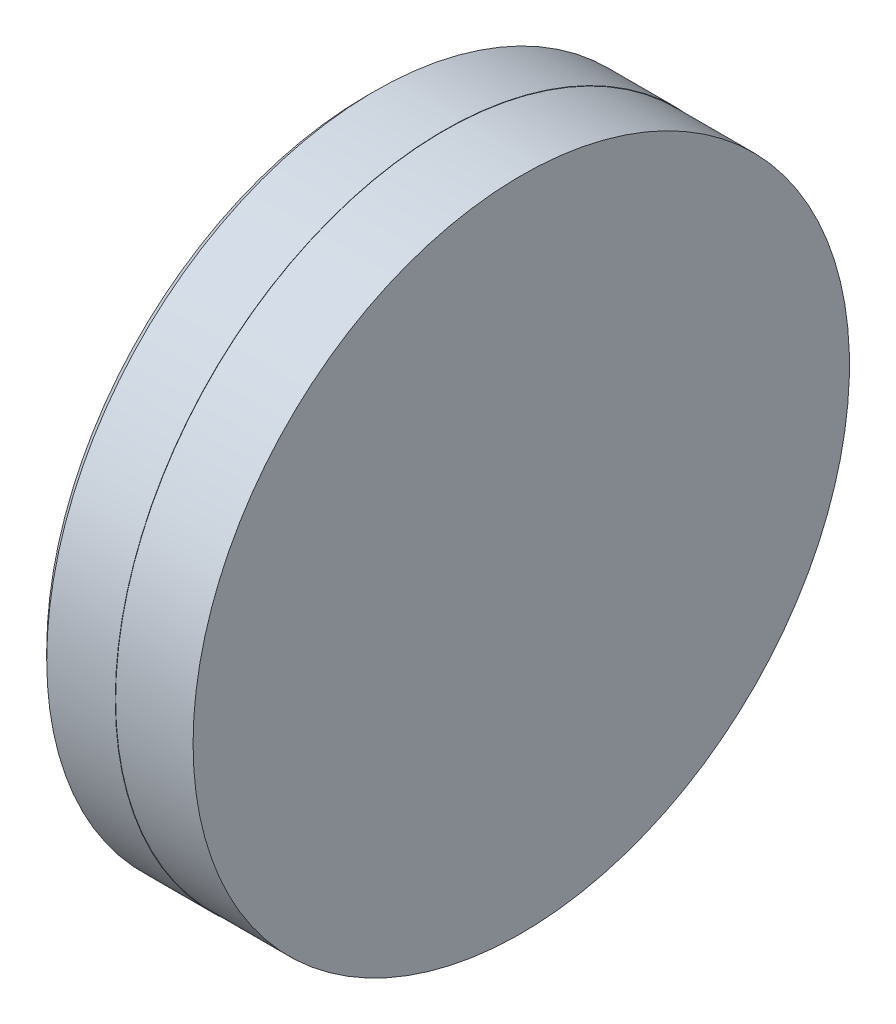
from build123d import *


with BuildPart() as part:
    # Sketch2 → Revolve3 (revolve)
    with BuildSketch(Plane.XY, mode=Mode.PRIVATE) as revolve3_sk:
        with BuildLine():
            Line((2.18, 9.25), (0.25, 9.25))
            Line((0.25, 9.25), (0, 9))
            ThreePointArc((0, 9), (2.521661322, 4.810405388), (3.4, 0))
            Line((3.4, 0), (4.36, 0))
            Line((4.36, 0), (4.36, 9.24))
            Line((4.36, 9.24), (2.18, 9.24))
            Line((2.18, 9.24), (2.18, 9.25))
        make_face()
    revolve(revolve3_sk.sketch.rotate(Axis((-0.560985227, 0, 0), (1, 0, 0)), 90), axis=Axis((-0.560985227, 0, 0), (1, 0, 0)))


solid = part.part
